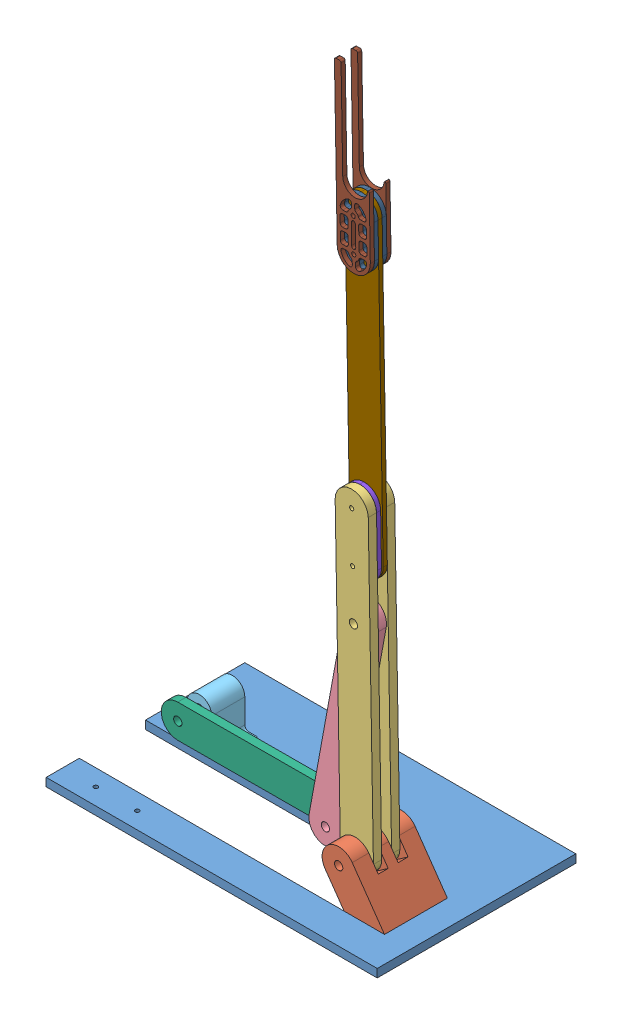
SolidWorks assembly Thrower.SLDASM, configuration Default (file format 14000). Lengths in mm.
Overall size (254 560.33 152.4).
14 component instances, 11 part files, 36 mates.
Components (placement in the parent):
- BasePlate-1: BasePlate.SLDPRT [Default] at (-29.8617 131.2554 261.6353) size (254 6.35 152.4)
- L4Hold-1: L4Hold.SLDPRT [Default] at (173.3383 137.6054 187.9753) x (0 0 1) z (-0.819152 -0.573576 0) size (48.26 55.89 25.4)
- L4-1: L4.SLDPRT [Default] at (169.1727 165.6963 201.9453) x (-0.017368 0.999849 0) z (0.999849 0.017368 0) size (254 6.35 25.4)
- L4-2: L4.SLDPRT [Default] at (169.1727 165.6963 215.9153) x (-0.017368 0.999849 0) z (0.999849 0.017368 0) size (254 6.35 25.4)
- L3-1: L3.SLDPRT [Default] at (138.6667 166.0974 209.5653) x (0.180308 0.98361 0) z (0.98361 -0.180308 0) size (179.91 6.35 25.4)
- FirstL1Hold-1: FirstL1Hold.SLDPRT [Default] at (11.4133 165.6963 160.0353) size (38.1 37.62 25.4)
- L2-1: L2.SLDPRT [Default] at (11.4133 165.6963 201.9453) x (0.999995 0.003152 0) z (-0.003152 0.999995 0) size (152.65 6.35 25.4)
- ArmSpacer-1: ArmSpacer.SLDPRT [Default] at (138.6667 166.0974 209.5653) x (1 0 0) z (0 1 0) size (25.4 7.62 25.4)
- L4UpperSpacer-1: L4UpperSpacer.SLDPRT [Default] at (153.3866 343.2489 215.9153) x (-0.017368 0.999849 0) z (-0.999849 -0.017368 0) size (63.5 3.17 25.4)
- L4Upper-2: L4Upper.SLDPRT [Default] at (178.7827 343.69 208.2953) x (-0.017368 0.999849 0) z (0.999849 0.017368 0) size (254 3.17 25.4)
- BallHolderSpace-1: BallHolderSpace.SLDPRT [Default] at (174.3712 597.6517 214.6453) x (0.017368 -0.999849 0) z (0.999849 0.017368 0) size (50.8 3.17 25.4)
- BallHolderSpace-2: BallHolderSpace.SLDPRT [Default] at (174.3712 597.6517 208.2953) x (0.017368 -0.999849 0) z (0.999849 0.017368 0) size (50.8 3.17 25.4)
- BallHolder-3: BallHolder.SLDPRT [Default] at (175.2535 546.8594 214.6453) x (-0.017368 0.999849 0) z (0.999849 0.017368 0) size (136.53 3.17 25.4)
- BallHolder-4: BallHolder.SLDPRT [Default] at (175.2535 546.8594 201.9453) x (-0.017368 0.999849 0) z (0.999849 0.017368 0) size (136.53 3.17 25.4)
Mates (geometry in assembly coordinates):
- Coincident1: coincident anti-aligned: plane of BasePlate-1 through (-29.8617 137.6054 261.6353) normal (0 1 0); plane of L4Hold-1 through (173.3383 137.6054 187.9753) normal (0 -1 0)
- Coincident2: coincident anti-aligned: plane of BasePlate-1 through (-29.8617 131.2554 236.2353) normal (0 0 -1); plane of L4Hold-1 through (166.0539 148.0086 236.2353) normal (0 0 1)
- Coincident3: coincident: plane of BasePlate-1 through (173.3383 131.2554 185.4353) normal (-1 0 0); line of L4Hold-1 through (173.3383 137.6054 187.9753) axis (0 0 1)
- Concentric1: concentric anti-aligned: cylinder of L4Hold-1 through (169.1727 165.6963 176.5453) axis (0 0 1) radius 3.175; cylinder of L4-1 through (169.1727 165.6963 208.2953) axis (0 0 -1) radius 3.175
- Coincident4: coincident anti-aligned: plane of L4Hold-1 through (172.2915 183.3839 208.2953) normal (0 0 -1); plane of L4-1 through (169.1727 165.6963 208.2953) normal (0 0 1)
- Concentric2: concentric anti-aligned: cylinder of L4Hold-1 through (169.1727 165.6963 176.5453) axis (0 0 1) radius 3.175; cylinder of L4-2 through (169.1727 165.6963 222.2653) axis (0 0 -1) radius 3.175
- Coincident5: coincident anti-aligned: plane of L4Hold-1 through (172.2915 183.3839 215.9153) normal (0 0 1); plane of L4-2 through (169.1727 165.6963 215.9153) normal (0 0 -1)
- Concentric3: concentric aligned: cylinder of L4-1 through (165.2024 394.2618 208.2953) axis (0 0 -1) radius 1.5875; cylinder of L4-2 through (165.2024 394.2618 222.2653) axis (0 0 -1) radius 1.5875
- Concentric4: concentric anti-aligned: cylinder of L4-2 through (166.5258 318.0733 215.9153) axis (0 0 1) radius 3.175; cylinder of L3-1 through (166.5258 318.0733 215.9153) axis (0 0 -1) radius 3.175
- Coincident6: coincident anti-aligned: plane of L4-2 through (169.1727 165.6963 215.9153) normal (0 0 -1); plane of L3-1 through (138.6667 166.0974 215.9153) normal (0 0 1)
- Coincident7: coincident anti-aligned: plane of BasePlate-1 through (-29.8617 137.6054 261.6353) normal (0 1 0); plane of FirstL1Hold-1 through (11.4133 137.6054 185.4353) normal (0 -1 0)
- Concentric5: concentric aligned: cylinder of BasePlate-1 through (-4.4617 112.2054 172.7353) axis (0 1 0) radius 1.5875; cylinder of FirstL1Hold-1 through (-4.4617 118.5554 172.7353) axis (0 1 0) radius 1.5875
- Concentric7: concentric aligned: cylinder of BasePlate-1 through (27.2883 112.2054 172.7353) axis (0 1 0) radius 1.5875; cylinder of FirstL1Hold-1 through (27.2883 118.5554 172.7353) axis (0 1 0) radius 1.5875
- Concentric9: concentric anti-aligned: cylinder of FirstL1Hold-1 through (11.4133 165.6963 185.4353) axis (0 0 -1) radius 3.175; cylinder of L2-1 through (11.4133 165.6963 195.5953) axis (0 0 1) radius 3.175
- Concentric11: concentric anti-aligned: cylinder of L3-1 through (138.6667 166.0974 215.9153) axis (0 0 -1) radius 3.175; cylinder of L2-1 through (138.6667 166.0974 195.5953) axis (0 0 1) radius 3.175
- Concentric12: concentric anti-aligned: cylinder of L2-1 through (138.6667 166.0974 195.5953) axis (0 0 1) radius 3.175; cylinder of ArmSpacer-1 through (138.6667 166.0974 209.5653) axis (0 0 -1) radius 3.175
- Coincident10: coincident anti-aligned: plane of L2-1 through (11.4133 165.6963 201.9453) normal (0 0 1); plane of ArmSpacer-1 through (138.6667 166.0974 201.9453) normal (0 0 -1)
- Coincident11: coincident anti-aligned: plane of L3-1 through (138.6667 166.0974 209.5653) normal (0 0 -1); plane of ArmSpacer-1 through (138.6667 166.0974 209.5653) normal (0 0 1)
- Concentric13: concentric anti-aligned: cylinder of L4-2 through (165.8641 356.1675 215.9153) axis (0 0 1) radius 1.5875; cylinder of L4UpperSpacer-1 through (165.8641 356.1675 215.9153) axis (0 0 -1) radius 1.5875
- Concentric16: concentric aligned: cylinder of L4-2 through (165.2024 394.2618 222.2653) axis (0 0 -1) radius 1.5875; cylinder of L4UpperSpacer-1 through (165.2024 394.2618 215.9153) axis (0 0 -1) radius 1.5875
- Coincident13: coincident anti-aligned: plane of L4-2 through (169.1727 165.6963 215.9153) normal (0 0 -1); plane of L4UpperSpacer-1 through (153.3866 343.2489 215.9153) normal (0 0 1)
- Concentric17: concentric anti-aligned: cylinder of L4-1 through (165.2024 394.2618 208.2953) axis (0 0 -1) radius 1.5875; cylinder of L4Upper-2 through (165.2024 394.2618 208.2953) axis (0 0 1) radius 1.5875
- Concentric18: concentric aligned: cylinder of L4-1 through (165.8641 356.1675 201.9453) axis (0 0 1) radius 1.5875; cylinder of L4Upper-2 through (165.8641 356.1675 208.2953) axis (0 0 1) radius 1.5875
- Coincident14: coincident anti-aligned: plane of L4-1 through (169.1727 165.6963 208.2953) normal (0 0 1); plane of L4Upper-2 through (178.7827 343.69 208.2953) normal (0 0 -1)
- Concentric19: concentric anti-aligned: cylinder of L4Upper-2 through (161.8937 584.733 203.8503) axis (0 0 1) radius 1.5875; cylinder of BallHolderSpace-1 through (161.8937 584.733 214.6453) axis (0 0 -1) radius 1.5875
- Concentric20: concentric anti-aligned: cylinder of L4Upper-2 through (162.3349 559.3369 203.8503) axis (0 0 1) radius 1.5875; cylinder of BallHolderSpace-1 through (162.3349 559.3369 214.6453) axis (0 0 -1) radius 1.5875
- Coincident15: coincident anti-aligned: plane of L4Upper-2 through (178.7827 343.69 211.4703) normal (0 0 1); plane of BallHoldSpace-1 through (174.3712 597.6517 211.4703) normal (0 0 -1)
- Concentric21: concentric aligned: cylinder of BallHolderSpace-1 through (161.8937 584.733 214.6453) axis (0 0 -1) radius 1.5875; cylinder of BallHolderSpace-2 through (161.8937 584.733 208.2953) axis (0 0 -1) radius 1.5875
- Concentric22: concentric aligned: cylinder of BallHolderSpace-1 through (162.3349 559.3369 214.6453) axis (0 0 -1) radius 1.5875; cylinder of BallHolderSpace-2 through (162.3349 559.3369 208.2953) axis (0 0 -1) radius 1.5875
- Coincident16: coincident anti-aligned: plane of L4Upper-2 through (178.7827 343.69 208.2953) normal (0 0 -1); plane of BallHolderSpace-2 through (174.3712 597.6517 208.2953) normal (0 0 1)
- Concentric27: concentric anti-aligned: cylinder of BallHolderSpace-2 through (161.8937 584.733 208.2953) axis (0 0 -1) radius 1.5875; cylinder of BallHolder-3 through (161.8937 584.733 214.6453) axis (0 0 1) radius 1.5875
- Coincident19: coincident anti-aligned: plane of BallHolderSpace-1 through (174.3712 597.6517 214.6453) normal (0 0 1); plane of BallHolder-3 through (175.2535 546.8594 214.6453) normal (0 0 -1)
- Concentric28: concentric anti-aligned: cylinder of BallHolderSpace-1 through (162.3349 559.3369 214.6453) axis (0 0 -1) radius 1.5875; cylinder of BallHolder-3 through (162.3349 559.3369 214.6453) axis (0 0 1) radius 1.5875
- Concentric29: concentric anti-aligned: cylinder of BallHolderSpace-2 through (162.3349 559.3369 208.2953) axis (0 0 -1) radius 1.5875; cylinder of BallHolder-4 through (162.3349 559.3369 201.9453) axis (0 0 1) radius 1.5875
- Coincident20: coincident anti-aligned: plane of BallHolderSpace-2 through (174.3712 597.6517 205.1203) normal (0 0 -1); plane of BallHolder-4 through (175.2535 546.8594 205.1203) normal (0 0 1)
- Concentric30: concentric anti-aligned: cylinder of BallHolderSpace-2 through (161.8937 584.733 208.2953) axis (0 0 -1) radius 1.5875; cylinder of BallHolder-4 through (161.8937 584.733 201.9453) axis (0 0 1) radius 1.5875
